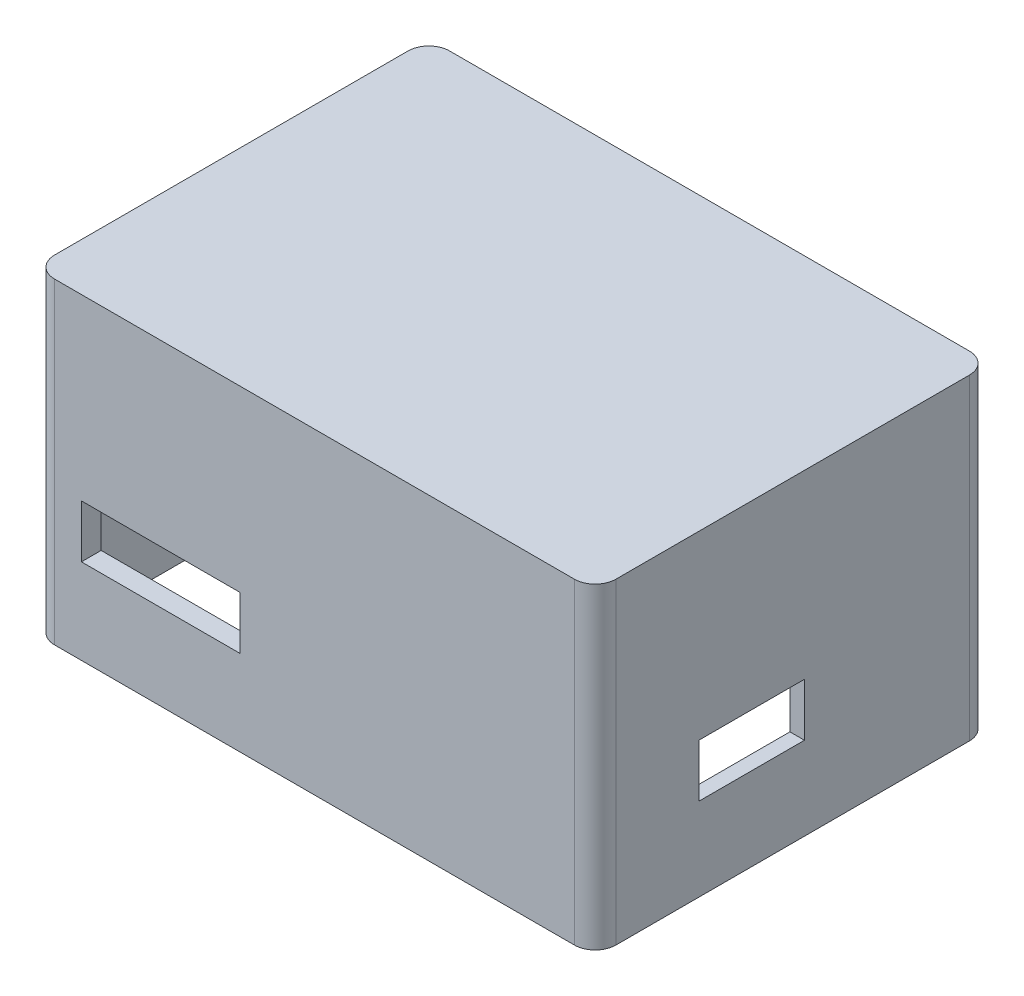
ISO-10303-21;
HEADER;
FILE_DESCRIPTION(('STEP AP214'),'2;1');
FILE_NAME('part.step','',(''),(''),'','','');
FILE_SCHEMA(('AUTOMOTIVE_DESIGN { 1 0 10303 214 1 1 1 1 }'));
ENDSEC;
DATA;
#1=APPLICATION_CONTEXT('core data for automotive mechanical design processes');
#2=APPLICATION_PROTOCOL_DEFINITION('international standard','automotive_design',2000,#1);
#3=PRODUCT_CONTEXT('',#1,'mechanical');
#4=PRODUCT('Part','Part','',(#3));
#5=PRODUCT_RELATED_PRODUCT_CATEGORY('part','',(#4));
#6=PRODUCT_DEFINITION_FORMATION('','',#4);
#7=PRODUCT_DEFINITION_CONTEXT('part definition',#1,'design');
#8=PRODUCT_DEFINITION('design','',#6,#7);
#9=PRODUCT_DEFINITION_SHAPE('','',#8);
#10=(LENGTH_UNIT() NAMED_UNIT(*) SI_UNIT(.MILLI.,.METRE.));
#11=(NAMED_UNIT(*) PLANE_ANGLE_UNIT() SI_UNIT($,.RADIAN.));
#12=(NAMED_UNIT(*) SI_UNIT($,.STERADIAN.) SOLID_ANGLE_UNIT());
#13=UNCERTAINTY_MEASURE_WITH_UNIT(LENGTH_MEASURE(1.E-05),#10,'distance_accuracy_value','');
#14=(GEOMETRIC_REPRESENTATION_CONTEXT(3) GLOBAL_UNCERTAINTY_ASSIGNED_CONTEXT((#13)) GLOBAL_UNIT_ASSIGNED_CONTEXT((#10,
#11,#12)) REPRESENTATION_CONTEXT('',''));
#15=CARTESIAN_POINT('',(0.,0.,0.));
#16=DIRECTION('',(0.,0.,1.));
#17=DIRECTION('',(1.,0.,0.));
#18=AXIS2_PLACEMENT_3D('',#15,#16,#17);
#19=CARTESIAN_POINT('',(0.,76.2,0.));
#20=DIRECTION('',(1.,0.,0.));
#21=DIRECTION('',(0.,0.,-1.));
#22=AXIS2_PLACEMENT_3D('',#19,#20,#21);
#23=PLANE('',#22);
#24=DIRECTION('',(0.,0.,1.));
#25=VECTOR('',#24,1.);
#26=CARTESIAN_POINT('',(0.,0.,0.));
#27=LINE('',#26,#25);
#28=CARTESIAN_POINT('',(0.,0.,-90.));
#29=VERTEX_POINT('',#28);
#30=CARTESIAN_POINT('',(0.,0.,-5.));
#31=VERTEX_POINT('',#30);
#32=EDGE_CURVE('E363',#29,#31,#27,.T.);
#33=ORIENTED_EDGE('',*,*,#32,.T.);
#34=DIRECTION('',(0.,-1.,0.));
#35=VECTOR('',#34,1.);
#36=CARTESIAN_POINT('',(0.,76.2,-5.));
#37=LINE('',#36,#35);
#38=CARTESIAN_POINT('',(0.,76.2,-5.));
#39=VERTEX_POINT('',#38);
#40=EDGE_CURVE('E446',#31,#39,#37,.F.);
#41=ORIENTED_EDGE('',*,*,#40,.T.);
#42=DIRECTION('',(0.,0.,1.));
#43=VECTOR('',#42,1.);
#44=CARTESIAN_POINT('',(0.,76.2,0.));
#45=LINE('',#44,#43);
#46=CARTESIAN_POINT('',(0.,76.2,-90.));
#47=VERTEX_POINT('',#46);
#48=EDGE_CURVE('E373',#47,#39,#45,.T.);
#49=ORIENTED_EDGE('',*,*,#48,.F.);
#50=DIRECTION('',(0.,-1.,0.));
#51=VECTOR('',#50,1.);
#52=CARTESIAN_POINT('',(0.,76.2,-90.));
#53=LINE('',#52,#51);
#54=EDGE_CURVE('E442',#47,#29,#53,.T.);
#55=ORIENTED_EDGE('',*,*,#54,.T.);
#56=EDGE_LOOP('',(#33,#41,#49,#55));
#57=FACE_BOUND('',#56,.T.);
#58=ADVANCED_FACE('F39',(#57),#23,.F.);
#59=CARTESIAN_POINT('',(0.,76.2,0.));
#60=DIRECTION('',(0.,0.,-1.));
#61=DIRECTION('',(-1.,0.,0.));
#62=AXIS2_PLACEMENT_3D('',#59,#60,#61);
#63=PLANE('',#62);
#64=DIRECTION('',(1.,0.,0.));
#65=VECTOR('',#64,1.);
#66=CARTESIAN_POINT('',(49.5569415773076,33.2344344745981,0.));
#67=LINE('',#66,#65);
#68=CARTESIAN_POINT('',(11.4569415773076,33.2344344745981,0.));
#69=VERTEX_POINT('',#68);
#70=CARTESIAN_POINT('',(49.5569415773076,33.2344344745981,0.));
#71=VERTEX_POINT('',#70);
#72=EDGE_CURVE('E298',#69,#71,#67,.T.);
#73=ORIENTED_EDGE('',*,*,#72,.T.);
#74=DIRECTION('',(0.,-1.,0.));
#75=VECTOR('',#74,1.);
#76=CARTESIAN_POINT('',(49.5569415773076,33.2344344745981,0.));
#77=LINE('',#76,#75);
#78=CARTESIAN_POINT('',(49.5569415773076,20.5344344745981,0.));
#79=VERTEX_POINT('',#78);
#80=EDGE_CURVE('E285',#71,#79,#77,.T.);
#81=ORIENTED_EDGE('',*,*,#80,.T.);
#82=DIRECTION('',(-1.,0.,0.));
#83=VECTOR('',#82,1.);
#84=CARTESIAN_POINT('',(49.5569415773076,20.5344344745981,0.));
#85=LINE('',#84,#83);
#86=CARTESIAN_POINT('',(11.4569415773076,20.5344344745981,0.));
#87=VERTEX_POINT('',#86);
#88=EDGE_CURVE('E289',#79,#87,#85,.T.);
#89=ORIENTED_EDGE('',*,*,#88,.T.);
#90=DIRECTION('',(0.,1.,0.));
#91=VECTOR('',#90,1.);
#92=CARTESIAN_POINT('',(11.4569415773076,33.2344344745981,0.));
#93=LINE('',#92,#91);
#94=EDGE_CURVE('E294',#87,#69,#93,.T.);
#95=ORIENTED_EDGE('',*,*,#94,.T.);
#96=EDGE_LOOP('',(#73,#81,#89,#95));
#97=FACE_BOUND('',#96,.T.);
#98=DIRECTION('',(1.,0.,0.));
#99=VECTOR('',#98,1.);
#100=CARTESIAN_POINT('',(0.,0.,0.));
#101=LINE('',#100,#99);
#102=CARTESIAN_POINT('',(5.,0.,0.));
#103=VERTEX_POINT('',#102);
#104=CARTESIAN_POINT('',(130.,0.,0.));
#105=VERTEX_POINT('',#104);
#106=EDGE_CURVE('E394',#103,#105,#101,.T.);
#107=ORIENTED_EDGE('',*,*,#106,.T.);
#108=DIRECTION('',(0.,-1.,0.));
#109=VECTOR('',#108,1.);
#110=CARTESIAN_POINT('',(130.,76.2,0.));
#111=LINE('',#110,#109);
#112=CARTESIAN_POINT('',(130.,76.2,0.));
#113=VERTEX_POINT('',#112);
#114=EDGE_CURVE('E427',#105,#113,#111,.F.);
#115=ORIENTED_EDGE('',*,*,#114,.T.);
#116=DIRECTION('',(1.,0.,0.));
#117=VECTOR('',#116,1.);
#118=CARTESIAN_POINT('',(0.,76.2,0.));
#119=LINE('',#118,#117);
#120=CARTESIAN_POINT('',(5.,76.2,0.));
#121=VERTEX_POINT('',#120);
#122=EDGE_CURVE('E377',#121,#113,#119,.T.);
#123=ORIENTED_EDGE('',*,*,#122,.F.);
#124=DIRECTION('',(0.,-1.,0.));
#125=VECTOR('',#124,1.);
#126=CARTESIAN_POINT('',(5.,76.2,0.));
#127=LINE('',#126,#125);
#128=EDGE_CURVE('E423',#121,#103,#127,.T.);
#129=ORIENTED_EDGE('',*,*,#128,.T.);
#130=EDGE_LOOP('',(#107,#115,#123,#129));
#131=FACE_BOUND('',#130,.T.);
#132=ADVANCED_FACE('F569',(#97,#131),#63,.F.);
#133=CARTESIAN_POINT('',(135.,76.2,0.));
#134=DIRECTION('',(-1.,0.,0.));
#135=DIRECTION('',(0.,0.,1.));
#136=AXIS2_PLACEMENT_3D('',#133,#134,#135);
#137=PLANE('',#136);
#138=DIRECTION('',(0.,0.,-1.));
#139=VECTOR('',#138,1.);
#140=CARTESIAN_POINT('',(135.,32.6862826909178,-50.3285327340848));
#141=LINE('',#140,#139);
#142=CARTESIAN_POINT('',(135.,32.6862826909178,-24.9285327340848));
#143=VERTEX_POINT('',#142);
#144=CARTESIAN_POINT('',(135.,32.6862826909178,-50.3285327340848));
#145=VERTEX_POINT('',#144);
#146=EDGE_CURVE('E239',#143,#145,#141,.T.);
#147=ORIENTED_EDGE('',*,*,#146,.T.);
#148=DIRECTION('',(0.,-1.,0.));
#149=VECTOR('',#148,1.);
#150=CARTESIAN_POINT('',(135.,19.9862826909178,-50.3285327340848));
#151=LINE('',#150,#149);
#152=CARTESIAN_POINT('',(135.,19.9862826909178,-50.3285327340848));
#153=VERTEX_POINT('',#152);
#154=EDGE_CURVE('E230',#145,#153,#151,.T.);
#155=ORIENTED_EDGE('',*,*,#154,.T.);
#156=DIRECTION('',(0.,0.,1.));
#157=VECTOR('',#156,1.);
#158=CARTESIAN_POINT('',(135.,19.9862826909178,-50.3285327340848));
#159=LINE('',#158,#157);
#160=CARTESIAN_POINT('',(135.,19.9862826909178,-24.9285327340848));
#161=VERTEX_POINT('',#160);
#162=EDGE_CURVE('E243',#153,#161,#159,.T.);
#163=ORIENTED_EDGE('',*,*,#162,.T.);
#164=DIRECTION('',(0.,1.,0.));
#165=VECTOR('',#164,1.);
#166=CARTESIAN_POINT('',(135.,19.9862826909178,-24.9285327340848));
#167=LINE('',#166,#165);
#168=EDGE_CURVE('E248',#161,#143,#167,.T.);
#169=ORIENTED_EDGE('',*,*,#168,.T.);
#170=EDGE_LOOP('',(#147,#155,#163,#169));
#171=FACE_BOUND('',#170,.T.);
#172=DIRECTION('',(0.,0.,-1.));
#173=VECTOR('',#172,1.);
#174=CARTESIAN_POINT('',(135.,76.2,0.));
#175=LINE('',#174,#173);
#176=CARTESIAN_POINT('',(135.,76.2,-5.));
#177=VERTEX_POINT('',#176);
#178=CARTESIAN_POINT('',(135.,76.2,-90.));
#179=VERTEX_POINT('',#178);
#180=EDGE_CURVE('E382',#177,#179,#175,.T.);
#181=ORIENTED_EDGE('',*,*,#180,.F.);
#182=DIRECTION('',(0.,-1.,0.));
#183=VECTOR('',#182,1.);
#184=CARTESIAN_POINT('',(135.,76.2,-5.));
#185=LINE('',#184,#183);
#186=CARTESIAN_POINT('',(135.,0.,-5.));
#187=VERTEX_POINT('',#186);
#188=EDGE_CURVE('E407',#177,#187,#185,.T.);
#189=ORIENTED_EDGE('',*,*,#188,.T.);
#190=DIRECTION('',(0.,0.,-1.));
#191=VECTOR('',#190,1.);
#192=CARTESIAN_POINT('',(135.,0.,0.));
#193=LINE('',#192,#191);
#194=CARTESIAN_POINT('',(135.,0.,-90.));
#195=VERTEX_POINT('',#194);
#196=EDGE_CURVE('E398',#187,#195,#193,.T.);
#197=ORIENTED_EDGE('',*,*,#196,.T.);
#198=DIRECTION('',(0.,-1.,0.));
#199=VECTOR('',#198,1.);
#200=CARTESIAN_POINT('',(135.,76.2,-90.));
#201=LINE('',#200,#199);
#202=EDGE_CURVE('E390',#195,#179,#201,.F.);
#203=ORIENTED_EDGE('',*,*,#202,.T.);
#204=EDGE_LOOP('',(#181,#189,#197,#203));
#205=FACE_BOUND('',#204,.T.);
#206=ADVANCED_FACE('F250',(#171,#205),#137,.F.);
#207=CARTESIAN_POINT('',(0.,76.2,-95.));
#208=DIRECTION('',(0.,0.,1.));
#209=DIRECTION('',(1.,0.,0.));
#210=AXIS2_PLACEMENT_3D('',#207,#208,#209);
#211=PLANE('',#210);
#212=DIRECTION('',(-1.,0.,0.));
#213=VECTOR('',#212,1.);
#214=CARTESIAN_POINT('',(90.8970519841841,39.9633123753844,-95.));
#215=LINE('',#214,#213);
#216=CARTESIAN_POINT('',(84.5470519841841,39.9633123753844,-95.));
#217=VERTEX_POINT('',#216);
#218=CARTESIAN_POINT('',(52.7970519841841,39.9633123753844,-95.));
#219=VERTEX_POINT('',#218);
#220=EDGE_CURVE('E527',#217,#219,#215,.T.);
#221=ORIENTED_EDGE('',*,*,#220,.F.);
#222=CARTESIAN_POINT('',(84.5470519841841,46.3133123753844,-95.));
#223=DIRECTION('',(0.,0.,1.));
#224=DIRECTION('',(1.,0.,0.));
#225=AXIS2_PLACEMENT_3D('',#222,#223,#224);
#226=CIRCLE('',#225,6.35);
#227=CARTESIAN_POINT('',(90.8970519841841,46.3133123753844,-95.));
#228=VERTEX_POINT('',#227);
#229=EDGE_CURVE('E497',#217,#228,#226,.T.);
#230=ORIENTED_EDGE('',*,*,#229,.T.);
#231=DIRECTION('',(0.,-1.,0.));
#232=VECTOR('',#231,1.);
#233=CARTESIAN_POINT('',(90.8970519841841,59.0133123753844,-95.));
#234=LINE('',#233,#232);
#235=CARTESIAN_POINT('',(90.8970519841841,52.6633123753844,-95.));
#236=VERTEX_POINT('',#235);
#237=EDGE_CURVE('E546',#236,#228,#234,.T.);
#238=ORIENTED_EDGE('',*,*,#237,.F.);
#239=CARTESIAN_POINT('',(84.5470519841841,52.6633123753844,-95.));
#240=DIRECTION('',(0.,0.,1.));
#241=DIRECTION('',(1.,0.,0.));
#242=AXIS2_PLACEMENT_3D('',#239,#240,#241);
#243=CIRCLE('',#242,6.35);
#244=CARTESIAN_POINT('',(84.5470519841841,59.0133123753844,-95.));
#245=VERTEX_POINT('',#244);
#246=EDGE_CURVE('E503',#236,#245,#243,.T.);
#247=ORIENTED_EDGE('',*,*,#246,.T.);
#248=DIRECTION('',(1.,0.,0.));
#249=VECTOR('',#248,1.);
#250=CARTESIAN_POINT('',(90.8970519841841,59.0133123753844,-95.));
#251=LINE('',#250,#249);
#252=CARTESIAN_POINT('',(52.7970519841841,59.0133123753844,-95.));
#253=VERTEX_POINT('',#252);
#254=EDGE_CURVE('E261',#253,#245,#251,.T.);
#255=ORIENTED_EDGE('',*,*,#254,.F.);
#256=CARTESIAN_POINT('',(52.7970519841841,52.6633123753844,-95.));
#257=DIRECTION('',(0.,0.,1.));
#258=DIRECTION('',(1.,0.,0.));
#259=AXIS2_PLACEMENT_3D('',#256,#257,#258);
#260=CIRCLE('',#259,6.35);
#261=CARTESIAN_POINT('',(46.4470519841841,52.6633123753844,-95.));
#262=VERTEX_POINT('',#261);
#263=EDGE_CURVE('E48',#253,#262,#260,.T.);
#264=ORIENTED_EDGE('',*,*,#263,.T.);
#265=DIRECTION('',(0.,1.,0.));
#266=VECTOR('',#265,1.);
#267=CARTESIAN_POINT('',(46.4470519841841,59.0133123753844,-95.));
#268=LINE('',#267,#266);
#269=CARTESIAN_POINT('',(46.4470519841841,46.3133123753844,-95.));
#270=VERTEX_POINT('',#269);
#271=EDGE_CURVE('E520',#270,#262,#268,.T.);
#272=ORIENTED_EDGE('',*,*,#271,.F.);
#273=CARTESIAN_POINT('',(52.7970519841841,46.3133123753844,-95.));
#274=DIRECTION('',(0.,0.,1.));
#275=DIRECTION('',(1.,0.,0.));
#276=AXIS2_PLACEMENT_3D('',#273,#274,#275);
#277=CIRCLE('',#276,6.35);
#278=EDGE_CURVE('E509',#270,#219,#277,.T.);
#279=ORIENTED_EDGE('',*,*,#278,.T.);
#280=EDGE_LOOP('',(#221,#230,#238,#247,#255,#264,#272,#279));
#281=FACE_BOUND('',#280,.T.);
#282=DIRECTION('',(-1.,0.,0.));
#283=VECTOR('',#282,1.);
#284=CARTESIAN_POINT('',(0.,0.,-95.));
#285=LINE('',#284,#283);
#286=CARTESIAN_POINT('',(130.,0.,-95.));
#287=VERTEX_POINT('',#286);
#288=CARTESIAN_POINT('',(4.99999999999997,0.,-95.));
#289=VERTEX_POINT('',#288);
#290=EDGE_CURVE('E378',#287,#289,#285,.T.);
#291=ORIENTED_EDGE('',*,*,#290,.T.);
#292=DIRECTION('',(0.,-1.,0.));
#293=VECTOR('',#292,1.);
#294=CARTESIAN_POINT('',(4.99999999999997,76.2,-95.));
#295=LINE('',#294,#293);
#296=CARTESIAN_POINT('',(4.99999999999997,76.2,-95.));
#297=VERTEX_POINT('',#296);
#298=EDGE_CURVE('E453',#289,#297,#295,.F.);
#299=ORIENTED_EDGE('',*,*,#298,.T.);
#300=DIRECTION('',(-1.,0.,0.));
#301=VECTOR('',#300,1.);
#302=CARTESIAN_POINT('',(0.,76.2,-95.));
#303=LINE('',#302,#301);
#304=CARTESIAN_POINT('',(130.,76.2,-95.));
#305=VERTEX_POINT('',#304);
#306=EDGE_CURVE('E386',#305,#297,#303,.T.);
#307=ORIENTED_EDGE('',*,*,#306,.F.);
#308=DIRECTION('',(0.,-1.,0.));
#309=VECTOR('',#308,1.);
#310=CARTESIAN_POINT('',(130.,76.2,-95.));
#311=LINE('',#310,#309);
#312=EDGE_CURVE('E449',#305,#287,#311,.T.);
#313=ORIENTED_EDGE('',*,*,#312,.T.);
#314=EDGE_LOOP('',(#291,#299,#307,#313));
#315=FACE_BOUND('',#314,.T.);
#316=ADVANCED_FACE('F518',(#281,#315),#211,.F.);
#317=CARTESIAN_POINT('',(0.,76.2,0.));
#318=DIRECTION('',(0.,-1.,0.));
#319=DIRECTION('',(0.,0.,-1.));
#320=AXIS2_PLACEMENT_3D('',#317,#318,#319);
#321=PLANE('',#320);
#322=ORIENTED_EDGE('',*,*,#122,.T.);
#323=CARTESIAN_POINT('',(130.,76.2,-5.));
#324=DIRECTION('',(0.,-1.,0.));
#325=DIRECTION('',(0.,0.,-1.));
#326=AXIS2_PLACEMENT_3D('',#323,#324,#325);
#327=CIRCLE('',#326,5.);
#328=EDGE_CURVE('E439',#113,#177,#327,.F.);
#329=ORIENTED_EDGE('',*,*,#328,.T.);
#330=ORIENTED_EDGE('',*,*,#180,.T.);
#331=CARTESIAN_POINT('',(130.,76.2,-90.));
#332=DIRECTION('',(0.,-1.,0.));
#333=DIRECTION('',(0.,0.,-1.));
#334=AXIS2_PLACEMENT_3D('',#331,#332,#333);
#335=CIRCLE('',#334,5.);
#336=EDGE_CURVE('E430',#179,#305,#335,.F.);
#337=ORIENTED_EDGE('',*,*,#336,.T.);
#338=ORIENTED_EDGE('',*,*,#306,.T.);
#339=CARTESIAN_POINT('',(4.99999999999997,76.2,-90.));
#340=DIRECTION('',(0.,-1.,0.));
#341=DIRECTION('',(0.,0.,-1.));
#342=AXIS2_PLACEMENT_3D('',#339,#340,#341);
#343=CIRCLE('',#342,5.);
#344=EDGE_CURVE('E433',#297,#47,#343,.F.);
#345=ORIENTED_EDGE('',*,*,#344,.T.);
#346=ORIENTED_EDGE('',*,*,#48,.T.);
#347=CARTESIAN_POINT('',(5.,76.2,-5.));
#348=DIRECTION('',(0.,-1.,0.));
#349=DIRECTION('',(0.,0.,-1.));
#350=AXIS2_PLACEMENT_3D('',#347,#348,#349);
#351=CIRCLE('',#350,5.);
#352=EDGE_CURVE('E436',#39,#121,#351,.F.);
#353=ORIENTED_EDGE('',*,*,#352,.T.);
#354=EDGE_LOOP('',(#322,#329,#330,#337,#338,#345,#346,#353));
#355=FACE_BOUND('',#354,.T.);
#356=ADVANCED_FACE('F655',(#355),#321,.F.);
#357=CARTESIAN_POINT('',(0.,0.,0.));
#358=DIRECTION('',(0.,-1.,0.));
#359=DIRECTION('',(0.,0.,-1.));
#360=AXIS2_PLACEMENT_3D('',#357,#358,#359);
#361=PLANE('',#360);
#362=DIRECTION('',(0.,0.,1.));
#363=VECTOR('',#362,1.);
#364=CARTESIAN_POINT('',(131.5,0.,-90.1466666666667));
#365=LINE('',#364,#363);
#366=CARTESIAN_POINT('',(131.5,0.,-90.1466666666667));
#367=VERTEX_POINT('',#366);
#368=CARTESIAN_POINT('',(131.5,0.,-4.74666666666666));
#369=VERTEX_POINT('',#368);
#370=EDGE_CURVE('E319',#367,#369,#365,.T.);
#371=ORIENTED_EDGE('',*,*,#370,.F.);
#372=DIRECTION('',(1.,0.,0.));
#373=VECTOR('',#372,1.);
#374=CARTESIAN_POINT('',(131.5,0.,-90.1466666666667));
#375=LINE('',#374,#373);
#376=CARTESIAN_POINT('',(3.06377578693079,0.,-90.1466666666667));
#377=VERTEX_POINT('',#376);
#378=EDGE_CURVE('E334',#377,#367,#375,.T.);
#379=ORIENTED_EDGE('',*,*,#378,.F.);
#380=DIRECTION('',(0.,0.,-1.));
#381=VECTOR('',#380,1.);
#382=CARTESIAN_POINT('',(3.06377578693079,0.,-90.1466666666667));
#383=LINE('',#382,#381);
#384=CARTESIAN_POINT('',(3.06377578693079,0.,-4.74666666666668));
#385=VERTEX_POINT('',#384);
#386=EDGE_CURVE('E353',#385,#377,#383,.T.);
#387=ORIENTED_EDGE('',*,*,#386,.F.);
#388=DIRECTION('',(-1.,0.,0.));
#389=VECTOR('',#388,1.);
#390=CARTESIAN_POINT('',(131.5,0.,-4.74666666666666));
#391=LINE('',#390,#389);
#392=EDGE_CURVE('E349',#369,#385,#391,.T.);
#393=ORIENTED_EDGE('',*,*,#392,.F.);
#394=EDGE_LOOP('',(#371,#379,#387,#393));
#395=FACE_BOUND('',#394,.T.);
#396=ORIENTED_EDGE('',*,*,#196,.F.);
#397=CARTESIAN_POINT('',(130.,0.,-5.));
#398=DIRECTION('',(0.,-1.,0.));
#399=DIRECTION('',(0.,0.,-1.));
#400=AXIS2_PLACEMENT_3D('',#397,#398,#399);
#401=CIRCLE('',#400,5.);
#402=EDGE_CURVE('E420',#187,#105,#401,.T.);
#403=ORIENTED_EDGE('',*,*,#402,.T.);
#404=ORIENTED_EDGE('',*,*,#106,.F.);
#405=CARTESIAN_POINT('',(5.,0.,-5.));
#406=DIRECTION('',(0.,-1.,0.));
#407=DIRECTION('',(0.,0.,-1.));
#408=AXIS2_PLACEMENT_3D('',#405,#406,#407);
#409=CIRCLE('',#408,5.);
#410=EDGE_CURVE('E417',#103,#31,#409,.T.);
#411=ORIENTED_EDGE('',*,*,#410,.T.);
#412=ORIENTED_EDGE('',*,*,#32,.F.);
#413=CARTESIAN_POINT('',(4.99999999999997,0.,-90.));
#414=DIRECTION('',(0.,-1.,0.));
#415=DIRECTION('',(0.,0.,-1.));
#416=AXIS2_PLACEMENT_3D('',#413,#414,#415);
#417=CIRCLE('',#416,5.);
#418=EDGE_CURVE('E414',#29,#289,#417,.T.);
#419=ORIENTED_EDGE('',*,*,#418,.T.);
#420=ORIENTED_EDGE('',*,*,#290,.F.);
#421=CARTESIAN_POINT('',(130.,0.,-90.));
#422=DIRECTION('',(0.,-1.,0.));
#423=DIRECTION('',(0.,0.,-1.));
#424=AXIS2_PLACEMENT_3D('',#421,#422,#423);
#425=CIRCLE('',#424,5.);
#426=EDGE_CURVE('E411',#287,#195,#425,.T.);
#427=ORIENTED_EDGE('',*,*,#426,.T.);
#428=EDGE_LOOP('',(#396,#403,#404,#411,#412,#419,#420,#427));
#429=FACE_BOUND('',#428,.T.);
#430=ADVANCED_FACE('F653',(#395,#429),#361,.T.);
#431=CARTESIAN_POINT('',(131.5,63.5,-90.1466666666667));
#432=DIRECTION('',(1.,0.,0.));
#433=DIRECTION('',(0.,0.,-1.));
#434=AXIS2_PLACEMENT_3D('',#431,#432,#433);
#435=PLANE('',#434);
#436=DIRECTION('',(0.,0.,1.));
#437=VECTOR('',#436,1.);
#438=CARTESIAN_POINT('',(131.5,19.9862826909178,-50.3285327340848));
#439=LINE('',#438,#437);
#440=CARTESIAN_POINT('',(131.5,19.9862826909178,-50.3285327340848));
#441=VERTEX_POINT('',#440);
#442=CARTESIAN_POINT('',(131.5,19.9862826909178,-24.9285327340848));
#443=VERTEX_POINT('',#442);
#444=EDGE_CURVE('E270',#441,#443,#439,.T.);
#445=ORIENTED_EDGE('',*,*,#444,.F.);
#446=DIRECTION('',(0.,-1.,0.));
#447=VECTOR('',#446,1.);
#448=CARTESIAN_POINT('',(131.5,19.9862826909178,-50.3285327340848));
#449=LINE('',#448,#447);
#450=CARTESIAN_POINT('',(131.5,32.6862826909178,-50.3285327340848));
#451=VERTEX_POINT('',#450);
#452=EDGE_CURVE('E233',#451,#441,#449,.T.);
#453=ORIENTED_EDGE('',*,*,#452,.F.);
#454=DIRECTION('',(0.,0.,-1.));
#455=VECTOR('',#454,1.);
#456=CARTESIAN_POINT('',(131.5,32.6862826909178,-50.3285327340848));
#457=LINE('',#456,#455);
#458=CARTESIAN_POINT('',(131.5,32.6862826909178,-24.9285327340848));
#459=VERTEX_POINT('',#458);
#460=EDGE_CURVE('E254',#459,#451,#457,.T.);
#461=ORIENTED_EDGE('',*,*,#460,.F.);
#462=DIRECTION('',(0.,1.,0.));
#463=VECTOR('',#462,1.);
#464=CARTESIAN_POINT('',(131.5,19.9862826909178,-24.9285327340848));
#465=LINE('',#464,#463);
#466=EDGE_CURVE('E258',#443,#459,#465,.T.);
#467=ORIENTED_EDGE('',*,*,#466,.F.);
#468=EDGE_LOOP('',(#445,#453,#461,#467));
#469=FACE_BOUND('',#468,.T.);
#470=ORIENTED_EDGE('',*,*,#370,.T.);
#471=DIRECTION('',(0.,-1.,0.));
#472=VECTOR('',#471,1.);
#473=CARTESIAN_POINT('',(131.5,63.5,-4.74666666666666));
#474=LINE('',#473,#472);
#475=CARTESIAN_POINT('',(131.5,63.5,-4.74666666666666));
#476=VERTEX_POINT('',#475);
#477=EDGE_CURVE('E346',#476,#369,#474,.T.);
#478=ORIENTED_EDGE('',*,*,#477,.F.);
#479=DIRECTION('',(0.,0.,1.));
#480=VECTOR('',#479,1.);
#481=CARTESIAN_POINT('',(131.5,63.5,-90.1466666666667));
#482=LINE('',#481,#480);
#483=CARTESIAN_POINT('',(131.5,63.5,-90.1466666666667));
#484=VERTEX_POINT('',#483);
#485=EDGE_CURVE('E329',#484,#476,#482,.T.);
#486=ORIENTED_EDGE('',*,*,#485,.F.);
#487=DIRECTION('',(0.,-1.,0.));
#488=VECTOR('',#487,1.);
#489=CARTESIAN_POINT('',(131.5,63.5,-90.1466666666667));
#490=LINE('',#489,#488);
#491=EDGE_CURVE('E360',#484,#367,#490,.T.);
#492=ORIENTED_EDGE('',*,*,#491,.T.);
#493=EDGE_LOOP('',(#470,#478,#486,#492));
#494=FACE_BOUND('',#493,.T.);
#495=ADVANCED_FACE('F644',(#469,#494),#435,.F.);
#496=CARTESIAN_POINT('',(131.5,63.5,-90.1466666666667));
#497=DIRECTION('',(0.,0.,-1.));
#498=DIRECTION('',(-1.,0.,0.));
#499=AXIS2_PLACEMENT_3D('',#496,#497,#498);
#500=PLANE('',#499);
#501=DIRECTION('',(0.,1.,0.));
#502=VECTOR('',#501,1.);
#503=CARTESIAN_POINT('',(46.4470519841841,63.5,-90.1466666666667));
#504=LINE('',#503,#502);
#505=CARTESIAN_POINT('',(46.4470519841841,46.3133123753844,-90.1466666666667));
#506=VERTEX_POINT('',#505);
#507=CARTESIAN_POINT('',(46.4470519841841,52.6633123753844,-90.1466666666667));
#508=VERTEX_POINT('',#507);
#509=EDGE_CURVE('E459',#506,#508,#504,.T.);
#510=ORIENTED_EDGE('',*,*,#509,.T.);
#511=CARTESIAN_POINT('',(52.7970519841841,52.6633123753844,-90.1466666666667));
#512=DIRECTION('',(0.,0.,-1.));
#513=DIRECTION('',(-1.,0.,0.));
#514=AXIS2_PLACEMENT_3D('',#511,#512,#513);
#515=CIRCLE('',#514,6.35);
#516=CARTESIAN_POINT('',(52.7970519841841,59.0133123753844,-90.1466666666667));
#517=VERTEX_POINT('',#516);
#518=EDGE_CURVE('E11',#508,#517,#515,.T.);
#519=ORIENTED_EDGE('',*,*,#518,.T.);
#520=DIRECTION('',(1.,0.,0.));
#521=VECTOR('',#520,1.);
#522=CARTESIAN_POINT('',(131.5,59.0133123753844,-90.1466666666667));
#523=LINE('',#522,#521);
#524=CARTESIAN_POINT('',(84.5470519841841,59.0133123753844,-90.1466666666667));
#525=VERTEX_POINT('',#524);
#526=EDGE_CURVE('E462',#517,#525,#523,.T.);
#527=ORIENTED_EDGE('',*,*,#526,.T.);
#528=CARTESIAN_POINT('',(84.5470519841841,52.6633123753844,-90.1466666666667));
#529=DIRECTION('',(0.,0.,-1.));
#530=DIRECTION('',(-1.,0.,0.));
#531=AXIS2_PLACEMENT_3D('',#528,#529,#530);
#532=CIRCLE('',#531,6.35);
#533=CARTESIAN_POINT('',(90.8970519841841,52.6633123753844,-90.1466666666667));
#534=VERTEX_POINT('',#533);
#535=EDGE_CURVE('E506',#525,#534,#532,.T.);
#536=ORIENTED_EDGE('',*,*,#535,.T.);
#537=DIRECTION('',(0.,-1.,0.));
#538=VECTOR('',#537,1.);
#539=CARTESIAN_POINT('',(90.8970519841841,63.5,-90.1466666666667));
#540=LINE('',#539,#538);
#541=CARTESIAN_POINT('',(90.8970519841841,46.3133123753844,-90.1466666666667));
#542=VERTEX_POINT('',#541);
#543=EDGE_CURVE('E466',#534,#542,#540,.T.);
#544=ORIENTED_EDGE('',*,*,#543,.T.);
#545=CARTESIAN_POINT('',(84.5470519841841,46.3133123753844,-90.1466666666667));
#546=DIRECTION('',(0.,0.,-1.));
#547=DIRECTION('',(-1.,0.,0.));
#548=AXIS2_PLACEMENT_3D('',#545,#546,#547);
#549=CIRCLE('',#548,6.35);
#550=CARTESIAN_POINT('',(84.5470519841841,39.9633123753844,-90.1466666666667));
#551=VERTEX_POINT('',#550);
#552=EDGE_CURVE('E500',#542,#551,#549,.T.);
#553=ORIENTED_EDGE('',*,*,#552,.T.);
#554=DIRECTION('',(-1.,0.,0.));
#555=VECTOR('',#554,1.);
#556=CARTESIAN_POINT('',(131.5,39.9633123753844,-90.1466666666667));
#557=LINE('',#556,#555);
#558=CARTESIAN_POINT('',(52.7970519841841,39.9633123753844,-90.1466666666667));
#559=VERTEX_POINT('',#558);
#560=EDGE_CURVE('E456',#551,#559,#557,.T.);
#561=ORIENTED_EDGE('',*,*,#560,.T.);
#562=CARTESIAN_POINT('',(52.7970519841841,46.3133123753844,-90.1466666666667));
#563=DIRECTION('',(0.,0.,-1.));
#564=DIRECTION('',(-1.,0.,0.));
#565=AXIS2_PLACEMENT_3D('',#562,#563,#564);
#566=CIRCLE('',#565,6.35);
#567=EDGE_CURVE('E62',#559,#506,#566,.T.);
#568=ORIENTED_EDGE('',*,*,#567,.T.);
#569=EDGE_LOOP('',(#510,#519,#527,#536,#544,#553,#561,#568));
#570=FACE_BOUND('',#569,.T.);
#571=ORIENTED_EDGE('',*,*,#378,.T.);
#572=ORIENTED_EDGE('',*,*,#491,.F.);
#573=DIRECTION('',(1.,0.,0.));
#574=VECTOR('',#573,1.);
#575=CARTESIAN_POINT('',(131.5,63.5,-90.1466666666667));
#576=LINE('',#575,#574);
#577=CARTESIAN_POINT('',(3.06377578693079,63.5,-90.1466666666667));
#578=VERTEX_POINT('',#577);
#579=EDGE_CURVE('E342',#578,#484,#576,.T.);
#580=ORIENTED_EDGE('',*,*,#579,.F.);
#581=DIRECTION('',(0.,-1.,0.));
#582=VECTOR('',#581,1.);
#583=CARTESIAN_POINT('',(3.06377578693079,63.5,-90.1466666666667));
#584=LINE('',#583,#582);
#585=EDGE_CURVE('E364',#578,#377,#584,.T.);
#586=ORIENTED_EDGE('',*,*,#585,.T.);
#587=EDGE_LOOP('',(#571,#572,#580,#586));
#588=FACE_BOUND('',#587,.T.);
#589=ADVANCED_FACE('F530',(#570,#588),#500,.F.);
#590=CARTESIAN_POINT('',(3.06377578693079,63.5,-90.1466666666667));
#591=DIRECTION('',(-1.,0.,0.));
#592=DIRECTION('',(0.,0.,1.));
#593=AXIS2_PLACEMENT_3D('',#590,#591,#592);
#594=PLANE('',#593);
#595=ORIENTED_EDGE('',*,*,#386,.T.);
#596=ORIENTED_EDGE('',*,*,#585,.F.);
#597=DIRECTION('',(0.,0.,-1.));
#598=VECTOR('',#597,1.);
#599=CARTESIAN_POINT('',(3.06377578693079,63.5,-90.1466666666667));
#600=LINE('',#599,#598);
#601=CARTESIAN_POINT('',(3.06377578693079,63.5,-4.74666666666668));
#602=VERTEX_POINT('',#601);
#603=EDGE_CURVE('E338',#602,#578,#600,.T.);
#604=ORIENTED_EDGE('',*,*,#603,.F.);
#605=DIRECTION('',(0.,-1.,0.));
#606=VECTOR('',#605,1.);
#607=CARTESIAN_POINT('',(3.06377578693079,63.5,-4.74666666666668));
#608=LINE('',#607,#606);
#609=EDGE_CURVE('E367',#602,#385,#608,.T.);
#610=ORIENTED_EDGE('',*,*,#609,.T.);
#611=EDGE_LOOP('',(#595,#596,#604,#610));
#612=FACE_BOUND('',#611,.T.);
#613=ADVANCED_FACE('F643',(#612),#594,.F.);
#614=CARTESIAN_POINT('',(131.5,63.5,-4.74666666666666));
#615=DIRECTION('',(0.,0.,1.));
#616=DIRECTION('',(1.,0.,0.));
#617=AXIS2_PLACEMENT_3D('',#614,#615,#616);
#618=PLANE('',#617);
#619=DIRECTION('',(-1.,0.,0.));
#620=VECTOR('',#619,1.);
#621=CARTESIAN_POINT('',(49.5569415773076,20.5344344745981,-4.74666666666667));
#622=LINE('',#621,#620);
#623=CARTESIAN_POINT('',(49.5569415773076,20.5344344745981,-4.74666666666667));
#624=VERTEX_POINT('',#623);
#625=CARTESIAN_POINT('',(11.4569415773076,20.5344344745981,-4.74666666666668));
#626=VERTEX_POINT('',#625);
#627=EDGE_CURVE('E305',#624,#626,#622,.T.);
#628=ORIENTED_EDGE('',*,*,#627,.F.);
#629=DIRECTION('',(0.,-1.,0.));
#630=VECTOR('',#629,1.);
#631=CARTESIAN_POINT('',(49.5569415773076,33.2344344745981,-4.74666666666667));
#632=LINE('',#631,#630);
#633=CARTESIAN_POINT('',(49.5569415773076,33.2344344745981,-4.74666666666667));
#634=VERTEX_POINT('',#633);
#635=EDGE_CURVE('E279',#634,#624,#632,.T.);
#636=ORIENTED_EDGE('',*,*,#635,.F.);
#637=DIRECTION('',(1.,0.,0.));
#638=VECTOR('',#637,1.);
#639=CARTESIAN_POINT('',(49.5569415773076,33.2344344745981,-4.74666666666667));
#640=LINE('',#639,#638);
#641=CARTESIAN_POINT('',(11.4569415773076,33.2344344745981,-4.74666666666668));
#642=VERTEX_POINT('',#641);
#643=EDGE_CURVE('E290',#642,#634,#640,.T.);
#644=ORIENTED_EDGE('',*,*,#643,.F.);
#645=DIRECTION('',(0.,1.,0.));
#646=VECTOR('',#645,1.);
#647=CARTESIAN_POINT('',(11.4569415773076,33.2344344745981,-4.74666666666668));
#648=LINE('',#647,#646);
#649=EDGE_CURVE('E309',#626,#642,#648,.T.);
#650=ORIENTED_EDGE('',*,*,#649,.F.);
#651=EDGE_LOOP('',(#628,#636,#644,#650));
#652=FACE_BOUND('',#651,.T.);
#653=ORIENTED_EDGE('',*,*,#392,.T.);
#654=ORIENTED_EDGE('',*,*,#609,.F.);
#655=DIRECTION('',(-1.,0.,0.));
#656=VECTOR('',#655,1.);
#657=CARTESIAN_POINT('',(131.5,63.5,-4.74666666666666));
#658=LINE('',#657,#656);
#659=EDGE_CURVE('E333',#476,#602,#658,.T.);
#660=ORIENTED_EDGE('',*,*,#659,.F.);
#661=ORIENTED_EDGE('',*,*,#477,.T.);
#662=EDGE_LOOP('',(#653,#654,#660,#661));
#663=FACE_BOUND('',#662,.T.);
#664=ADVANCED_FACE('F639',(#652,#663),#618,.F.);
#665=CARTESIAN_POINT('',(0.,63.5,0.));
#666=DIRECTION('',(0.,-1.,0.));
#667=DIRECTION('',(0.,0.,-1.));
#668=AXIS2_PLACEMENT_3D('',#665,#666,#667);
#669=PLANE('',#668);
#670=ORIENTED_EDGE('',*,*,#485,.T.);
#671=ORIENTED_EDGE('',*,*,#659,.T.);
#672=ORIENTED_EDGE('',*,*,#603,.T.);
#673=ORIENTED_EDGE('',*,*,#579,.T.);
#674=EDGE_LOOP('',(#670,#671,#672,#673));
#675=FACE_BOUND('',#674,.T.);
#676=ADVANCED_FACE('F583',(#675),#669,.T.);
#677=CARTESIAN_POINT('',(130.,76.2,-5.));
#678=DIRECTION('',(0.,-1.,0.));
#679=DIRECTION('',(0.,0.,-1.));
#680=AXIS2_PLACEMENT_3D('',#677,#678,#679);
#681=CYLINDRICAL_SURFACE('',#680,5.);
#682=ORIENTED_EDGE('',*,*,#328,.F.);
#683=ORIENTED_EDGE('',*,*,#114,.F.);
#684=ORIENTED_EDGE('',*,*,#402,.F.);
#685=ORIENTED_EDGE('',*,*,#188,.F.);
#686=EDGE_LOOP('',(#682,#683,#684,#685));
#687=FACE_BOUND('',#686,.T.);
#688=ADVANCED_FACE('F579',(#687),#681,.T.);
#689=CARTESIAN_POINT('',(5.,76.2,-5.));
#690=DIRECTION('',(0.,-1.,0.));
#691=DIRECTION('',(0.,0.,-1.));
#692=AXIS2_PLACEMENT_3D('',#689,#690,#691);
#693=CYLINDRICAL_SURFACE('',#692,5.);
#694=ORIENTED_EDGE('',*,*,#352,.F.);
#695=ORIENTED_EDGE('',*,*,#40,.F.);
#696=ORIENTED_EDGE('',*,*,#410,.F.);
#697=ORIENTED_EDGE('',*,*,#128,.F.);
#698=EDGE_LOOP('',(#694,#695,#696,#697));
#699=FACE_BOUND('',#698,.T.);
#700=ADVANCED_FACE('F582',(#699),#693,.T.);
#701=CARTESIAN_POINT('',(4.99999999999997,76.2,-90.));
#702=DIRECTION('',(0.,-1.,0.));
#703=DIRECTION('',(0.,0.,-1.));
#704=AXIS2_PLACEMENT_3D('',#701,#702,#703);
#705=CYLINDRICAL_SURFACE('',#704,5.);
#706=ORIENTED_EDGE('',*,*,#344,.F.);
#707=ORIENTED_EDGE('',*,*,#298,.F.);
#708=ORIENTED_EDGE('',*,*,#418,.F.);
#709=ORIENTED_EDGE('',*,*,#54,.F.);
#710=EDGE_LOOP('',(#706,#707,#708,#709));
#711=FACE_BOUND('',#710,.T.);
#712=ADVANCED_FACE('F587',(#711),#705,.T.);
#713=CARTESIAN_POINT('',(130.,76.2,-90.));
#714=DIRECTION('',(0.,-1.,0.));
#715=DIRECTION('',(0.,0.,-1.));
#716=AXIS2_PLACEMENT_3D('',#713,#714,#715);
#717=CYLINDRICAL_SURFACE('',#716,5.);
#718=ORIENTED_EDGE('',*,*,#336,.F.);
#719=ORIENTED_EDGE('',*,*,#202,.F.);
#720=ORIENTED_EDGE('',*,*,#426,.F.);
#721=ORIENTED_EDGE('',*,*,#312,.F.);
#722=EDGE_LOOP('',(#718,#719,#720,#721));
#723=FACE_BOUND('',#722,.T.);
#724=ADVANCED_FACE('F591',(#723),#717,.T.);
#725=CARTESIAN_POINT('',(49.5569415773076,33.2344344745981,0.));
#726=DIRECTION('',(1.,0.,0.));
#727=DIRECTION('',(0.,1.,0.));
#728=AXIS2_PLACEMENT_3D('',#725,#726,#727);
#729=PLANE('',#728);
#730=ORIENTED_EDGE('',*,*,#635,.T.);
#731=DIRECTION('',(0.,0.,-1.));
#732=VECTOR('',#731,1.);
#733=CARTESIAN_POINT('',(49.5569415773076,20.5344344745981,0.));
#734=LINE('',#733,#732);
#735=EDGE_CURVE('E302',#79,#624,#734,.T.);
#736=ORIENTED_EDGE('',*,*,#735,.F.);
#737=ORIENTED_EDGE('',*,*,#80,.F.);
#738=DIRECTION('',(0.,0.,-1.));
#739=VECTOR('',#738,1.);
#740=CARTESIAN_POINT('',(49.5569415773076,33.2344344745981,0.));
#741=LINE('',#740,#739);
#742=EDGE_CURVE('E316',#71,#634,#741,.T.);
#743=ORIENTED_EDGE('',*,*,#742,.T.);
#744=EDGE_LOOP('',(#730,#736,#737,#743));
#745=FACE_BOUND('',#744,.T.);
#746=ADVANCED_FACE('F595',(#745),#729,.F.);
#747=CARTESIAN_POINT('',(49.5569415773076,33.2344344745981,0.));
#748=DIRECTION('',(0.,1.,0.));
#749=DIRECTION('',(0.,0.,1.));
#750=AXIS2_PLACEMENT_3D('',#747,#748,#749);
#751=PLANE('',#750);
#752=ORIENTED_EDGE('',*,*,#643,.T.);
#753=ORIENTED_EDGE('',*,*,#742,.F.);
#754=ORIENTED_EDGE('',*,*,#72,.F.);
#755=DIRECTION('',(0.,0.,-1.));
#756=VECTOR('',#755,1.);
#757=CARTESIAN_POINT('',(11.4569415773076,33.2344344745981,0.));
#758=LINE('',#757,#756);
#759=EDGE_CURVE('E320',#69,#642,#758,.T.);
#760=ORIENTED_EDGE('',*,*,#759,.T.);
#761=EDGE_LOOP('',(#752,#753,#754,#760));
#762=FACE_BOUND('',#761,.T.);
#763=ADVANCED_FACE('F623',(#762),#751,.F.);
#764=CARTESIAN_POINT('',(11.4569415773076,33.2344344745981,0.));
#765=DIRECTION('',(-1.,0.,0.));
#766=DIRECTION('',(0.,-1.,0.));
#767=AXIS2_PLACEMENT_3D('',#764,#765,#766);
#768=PLANE('',#767);
#769=ORIENTED_EDGE('',*,*,#649,.T.);
#770=ORIENTED_EDGE('',*,*,#759,.F.);
#771=ORIENTED_EDGE('',*,*,#94,.F.);
#772=DIRECTION('',(0.,0.,-1.));
#773=VECTOR('',#772,1.);
#774=CARTESIAN_POINT('',(11.4569415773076,20.5344344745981,0.));
#775=LINE('',#774,#773);
#776=EDGE_CURVE('E323',#87,#626,#775,.T.);
#777=ORIENTED_EDGE('',*,*,#776,.T.);
#778=EDGE_LOOP('',(#769,#770,#771,#777));
#779=FACE_BOUND('',#778,.T.);
#780=ADVANCED_FACE('F626',(#779),#768,.F.);
#781=CARTESIAN_POINT('',(49.5569415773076,20.5344344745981,0.));
#782=DIRECTION('',(0.,-1.,0.));
#783=DIRECTION('',(0.,0.,-1.));
#784=AXIS2_PLACEMENT_3D('',#781,#782,#783);
#785=PLANE('',#784);
#786=ORIENTED_EDGE('',*,*,#627,.T.);
#787=ORIENTED_EDGE('',*,*,#776,.F.);
#788=ORIENTED_EDGE('',*,*,#88,.F.);
#789=ORIENTED_EDGE('',*,*,#735,.T.);
#790=EDGE_LOOP('',(#786,#787,#788,#789));
#791=FACE_BOUND('',#790,.T.);
#792=ADVANCED_FACE('F622',(#791),#785,.F.);
#793=CARTESIAN_POINT('',(135.,19.9862826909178,-50.3285327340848));
#794=DIRECTION('',(0.,0.,-1.));
#795=DIRECTION('',(-1.,0.,0.));
#796=AXIS2_PLACEMENT_3D('',#793,#794,#795);
#797=PLANE('',#796);
#798=ORIENTED_EDGE('',*,*,#452,.T.);
#799=DIRECTION('',(-1.,0.,0.));
#800=VECTOR('',#799,1.);
#801=CARTESIAN_POINT('',(135.,19.9862826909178,-50.3285327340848));
#802=LINE('',#801,#800);
#803=EDGE_CURVE('E226',#153,#441,#802,.T.);
#804=ORIENTED_EDGE('',*,*,#803,.F.);
#805=ORIENTED_EDGE('',*,*,#154,.F.);
#806=DIRECTION('',(-1.,0.,0.));
#807=VECTOR('',#806,1.);
#808=CARTESIAN_POINT('',(135.,32.6862826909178,-50.3285327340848));
#809=LINE('',#808,#807);
#810=EDGE_CURVE('E276',#145,#451,#809,.T.);
#811=ORIENTED_EDGE('',*,*,#810,.T.);
#812=EDGE_LOOP('',(#798,#804,#805,#811));
#813=FACE_BOUND('',#812,.T.);
#814=ADVANCED_FACE('F228',(#813),#797,.F.);
#815=CARTESIAN_POINT('',(135.,32.6862826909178,-50.3285327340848));
#816=DIRECTION('',(0.,1.,0.));
#817=DIRECTION('',(0.,0.,1.));
#818=AXIS2_PLACEMENT_3D('',#815,#816,#817);
#819=PLANE('',#818);
#820=ORIENTED_EDGE('',*,*,#460,.T.);
#821=ORIENTED_EDGE('',*,*,#810,.F.);
#822=ORIENTED_EDGE('',*,*,#146,.F.);
#823=DIRECTION('',(-1.,0.,0.));
#824=VECTOR('',#823,1.);
#825=CARTESIAN_POINT('',(135.,32.6862826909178,-24.9285327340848));
#826=LINE('',#825,#824);
#827=EDGE_CURVE('E280',#143,#459,#826,.T.);
#828=ORIENTED_EDGE('',*,*,#827,.T.);
#829=EDGE_LOOP('',(#820,#821,#822,#828));
#830=FACE_BOUND('',#829,.T.);
#831=ADVANCED_FACE('F610',(#830),#819,.F.);
#832=CARTESIAN_POINT('',(135.,19.9862826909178,-24.9285327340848));
#833=DIRECTION('',(0.,0.,1.));
#834=DIRECTION('',(0.,-1.,0.));
#835=AXIS2_PLACEMENT_3D('',#832,#833,#834);
#836=PLANE('',#835);
#837=ORIENTED_EDGE('',*,*,#466,.T.);
#838=ORIENTED_EDGE('',*,*,#827,.F.);
#839=ORIENTED_EDGE('',*,*,#168,.F.);
#840=DIRECTION('',(-1.,0.,0.));
#841=VECTOR('',#840,1.);
#842=CARTESIAN_POINT('',(135.,19.9862826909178,-24.9285327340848));
#843=LINE('',#842,#841);
#844=EDGE_CURVE('E238',#161,#443,#843,.T.);
#845=ORIENTED_EDGE('',*,*,#844,.T.);
#846=EDGE_LOOP('',(#837,#838,#839,#845));
#847=FACE_BOUND('',#846,.T.);
#848=ADVANCED_FACE('F613',(#847),#836,.F.);
#849=CARTESIAN_POINT('',(135.,19.9862826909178,-50.3285327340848));
#850=DIRECTION('',(0.,-1.,0.));
#851=DIRECTION('',(0.,0.,-1.));
#852=AXIS2_PLACEMENT_3D('',#849,#850,#851);
#853=PLANE('',#852);
#854=ORIENTED_EDGE('',*,*,#444,.T.);
#855=ORIENTED_EDGE('',*,*,#844,.F.);
#856=ORIENTED_EDGE('',*,*,#162,.F.);
#857=ORIENTED_EDGE('',*,*,#803,.T.);
#858=EDGE_LOOP('',(#854,#855,#856,#857));
#859=FACE_BOUND('',#858,.T.);
#860=ADVANCED_FACE('F244',(#859),#853,.F.);
#861=CARTESIAN_POINT('',(90.8970519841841,59.0133123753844,-85.));
#862=DIRECTION('',(1.,0.,0.));
#863=DIRECTION('',(0.,1.,0.));
#864=AXIS2_PLACEMENT_3D('',#861,#862,#863);
#865=PLANE('',#864);
#866=ORIENTED_EDGE('',*,*,#237,.T.);
#867=DIRECTION('',(0.,0.,-1.));
#868=VECTOR('',#867,1.);
#869=CARTESIAN_POINT('',(90.8970519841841,46.3133123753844,-90.1466666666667));
#870=LINE('',#869,#868);
#871=EDGE_CURVE('E481',#228,#542,#870,.F.);
#872=ORIENTED_EDGE('',*,*,#871,.T.);
#873=ORIENTED_EDGE('',*,*,#543,.F.);
#874=DIRECTION('',(0.,0.,-1.));
#875=VECTOR('',#874,1.);
#876=CARTESIAN_POINT('',(90.8970519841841,52.6633123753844,-95.));
#877=LINE('',#876,#875);
#878=EDGE_CURVE('E477',#534,#236,#877,.T.);
#879=ORIENTED_EDGE('',*,*,#878,.T.);
#880=EDGE_LOOP('',(#866,#872,#873,#879));
#881=FACE_BOUND('',#880,.T.);
#882=ADVANCED_FACE('F543',(#881),#865,.F.);
#883=CARTESIAN_POINT('',(90.8970519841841,59.0133123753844,-85.));
#884=DIRECTION('',(0.,1.,0.));
#885=DIRECTION('',(0.,0.,1.));
#886=AXIS2_PLACEMENT_3D('',#883,#884,#885);
#887=PLANE('',#886);
#888=ORIENTED_EDGE('',*,*,#254,.T.);
#889=DIRECTION('',(0.,0.,-1.));
#890=VECTOR('',#889,1.);
#891=CARTESIAN_POINT('',(84.5470519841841,59.0133123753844,-90.1466666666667));
#892=LINE('',#891,#890);
#893=EDGE_CURVE('E488',#245,#525,#892,.F.);
#894=ORIENTED_EDGE('',*,*,#893,.T.);
#895=ORIENTED_EDGE('',*,*,#526,.F.);
#896=DIRECTION('',(0.,0.,-1.));
#897=VECTOR('',#896,1.);
#898=CARTESIAN_POINT('',(52.7970519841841,59.0133123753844,-95.));
#899=LINE('',#898,#897);
#900=EDGE_CURVE('E484',#517,#253,#899,.T.);
#901=ORIENTED_EDGE('',*,*,#900,.T.);
#902=EDGE_LOOP('',(#888,#894,#895,#901));
#903=FACE_BOUND('',#902,.T.);
#904=ADVANCED_FACE('F534',(#903),#887,.F.);
#905=CARTESIAN_POINT('',(46.4470519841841,59.0133123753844,-85.));
#906=DIRECTION('',(-1.,0.,0.));
#907=DIRECTION('',(0.,0.,1.));
#908=AXIS2_PLACEMENT_3D('',#905,#906,#907);
#909=PLANE('',#908);
#910=ORIENTED_EDGE('',*,*,#509,.F.);
#911=DIRECTION('',(0.,0.,-1.));
#912=VECTOR('',#911,1.);
#913=CARTESIAN_POINT('',(46.4470519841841,46.3133123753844,-95.));
#914=LINE('',#913,#912);
#915=EDGE_CURVE('E493',#506,#270,#914,.T.);
#916=ORIENTED_EDGE('',*,*,#915,.T.);
#917=ORIENTED_EDGE('',*,*,#271,.T.);
#918=DIRECTION('',(0.,0.,-1.));
#919=VECTOR('',#918,1.);
#920=CARTESIAN_POINT('',(46.4470519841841,52.6633123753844,-90.1466666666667));
#921=LINE('',#920,#919);
#922=EDGE_CURVE('E55',#262,#508,#921,.F.);
#923=ORIENTED_EDGE('',*,*,#922,.T.);
#924=EDGE_LOOP('',(#910,#916,#917,#923));
#925=FACE_BOUND('',#924,.T.);
#926=ADVANCED_FACE('F524',(#925),#909,.F.);
#927=CARTESIAN_POINT('',(90.8970519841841,39.9633123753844,-85.));
#928=DIRECTION('',(0.,-1.,0.));
#929=DIRECTION('',(0.,0.,-1.));
#930=AXIS2_PLACEMENT_3D('',#927,#928,#929);
#931=PLANE('',#930);
#932=ORIENTED_EDGE('',*,*,#560,.F.);
#933=DIRECTION('',(0.,0.,-1.));
#934=VECTOR('',#933,1.);
#935=CARTESIAN_POINT('',(84.5470519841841,39.9633123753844,-95.));
#936=LINE('',#935,#934);
#937=EDGE_CURVE('E473',#551,#217,#936,.T.);
#938=ORIENTED_EDGE('',*,*,#937,.T.);
#939=ORIENTED_EDGE('',*,*,#220,.T.);
#940=DIRECTION('',(0.,0.,-1.));
#941=VECTOR('',#940,1.);
#942=CARTESIAN_POINT('',(52.7970519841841,39.9633123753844,-90.1466666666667));
#943=LINE('',#942,#941);
#944=EDGE_CURVE('E470',#219,#559,#943,.F.);
#945=ORIENTED_EDGE('',*,*,#944,.T.);
#946=EDGE_LOOP('',(#932,#938,#939,#945));
#947=FACE_BOUND('',#946,.T.);
#948=ADVANCED_FACE('F552',(#947),#931,.F.);
#949=CARTESIAN_POINT('',(84.5470519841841,46.3133123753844,-85.));
#950=DIRECTION('',(0.,0.,1.));
#951=DIRECTION('',(1.,0.,0.));
#952=AXIS2_PLACEMENT_3D('',#949,#950,#951);
#953=CYLINDRICAL_SURFACE('',#952,6.35);
#954=ORIENTED_EDGE('',*,*,#552,.F.);
#955=ORIENTED_EDGE('',*,*,#871,.F.);
#956=ORIENTED_EDGE('',*,*,#229,.F.);
#957=ORIENTED_EDGE('',*,*,#937,.F.);
#958=EDGE_LOOP('',(#954,#955,#956,#957));
#959=FACE_BOUND('',#958,.T.);
#960=ADVANCED_FACE('F548',(#959),#953,.F.);
#961=CARTESIAN_POINT('',(84.5470519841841,52.6633123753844,-85.));
#962=DIRECTION('',(0.,0.,1.));
#963=DIRECTION('',(1.,0.,0.));
#964=AXIS2_PLACEMENT_3D('',#961,#962,#963);
#965=CYLINDRICAL_SURFACE('',#964,6.35);
#966=ORIENTED_EDGE('',*,*,#535,.F.);
#967=ORIENTED_EDGE('',*,*,#893,.F.);
#968=ORIENTED_EDGE('',*,*,#246,.F.);
#969=ORIENTED_EDGE('',*,*,#878,.F.);
#970=EDGE_LOOP('',(#966,#967,#968,#969));
#971=FACE_BOUND('',#970,.T.);
#972=ADVANCED_FACE('F537',(#971),#965,.F.);
#973=CARTESIAN_POINT('',(52.7970519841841,46.3133123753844,-85.));
#974=DIRECTION('',(0.,0.,1.));
#975=DIRECTION('',(1.,0.,0.));
#976=AXIS2_PLACEMENT_3D('',#973,#974,#975);
#977=CYLINDRICAL_SURFACE('',#976,6.35);
#978=ORIENTED_EDGE('',*,*,#567,.F.);
#979=ORIENTED_EDGE('',*,*,#944,.F.);
#980=ORIENTED_EDGE('',*,*,#278,.F.);
#981=ORIENTED_EDGE('',*,*,#915,.F.);
#982=EDGE_LOOP('',(#978,#979,#980,#981));
#983=FACE_BOUND('',#982,.T.);
#984=ADVANCED_FACE('F556',(#983),#977,.F.);
#985=CARTESIAN_POINT('',(52.7970519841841,52.6633123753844,-85.));
#986=DIRECTION('',(0.,0.,1.));
#987=DIRECTION('',(1.,0.,0.));
#988=AXIS2_PLACEMENT_3D('',#985,#986,#987);
#989=CYLINDRICAL_SURFACE('',#988,6.35);
#990=ORIENTED_EDGE('',*,*,#518,.F.);
#991=ORIENTED_EDGE('',*,*,#922,.F.);
#992=ORIENTED_EDGE('',*,*,#263,.F.);
#993=ORIENTED_EDGE('',*,*,#900,.F.);
#994=EDGE_LOOP('',(#990,#991,#992,#993));
#995=FACE_BOUND('',#994,.T.);
#996=ADVANCED_FACE('F41',(#995),#989,.F.);
#997=CLOSED_SHELL('',(#58,#132,#206,#316,#356,#430,#495,#589,#613,#664,#676,#688,#700,#712,#724,
#746,#763,#780,#792,#814,#831,#848,#860,#882,#904,#926,#948,#960,#972,#984,#996));
#998=MANIFOLD_SOLID_BREP('B2',#997);
#999=ADVANCED_BREP_SHAPE_REPRESENTATION('',(#18,#998),#14);
#1000=SHAPE_DEFINITION_REPRESENTATION(#9,#999);
ENDSEC;
END-ISO-10303-21;
